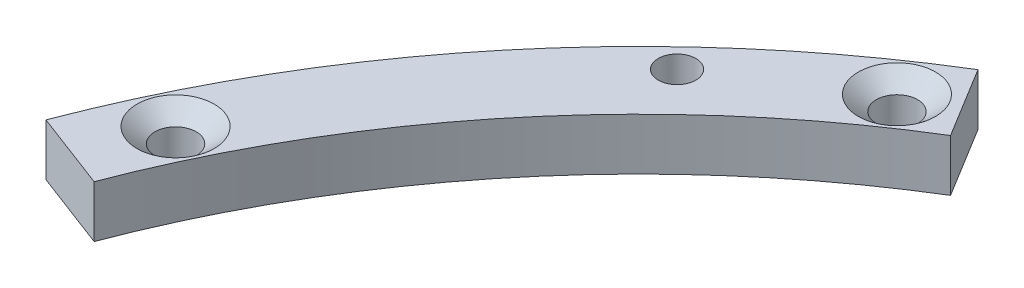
ISO-10303-21;
HEADER;
FILE_DESCRIPTION(('STEP AP214'),'2;1');
FILE_NAME('part.step','',(''),(''),'','','');
FILE_SCHEMA(('AUTOMOTIVE_DESIGN { 1 0 10303 214 1 1 1 1 }'));
ENDSEC;
DATA;
#1=APPLICATION_CONTEXT('core data for automotive mechanical design processes');
#2=APPLICATION_PROTOCOL_DEFINITION('international standard','automotive_design',2000,#1);
#3=PRODUCT_CONTEXT('',#1,'mechanical');
#4=PRODUCT('Part','Part','',(#3));
#5=PRODUCT_RELATED_PRODUCT_CATEGORY('part','',(#4));
#6=PRODUCT_DEFINITION_FORMATION('','',#4);
#7=PRODUCT_DEFINITION_CONTEXT('part definition',#1,'design');
#8=PRODUCT_DEFINITION('design','',#6,#7);
#9=PRODUCT_DEFINITION_SHAPE('','',#8);
#10=(LENGTH_UNIT() NAMED_UNIT(*) SI_UNIT(.MILLI.,.METRE.));
#11=(NAMED_UNIT(*) PLANE_ANGLE_UNIT() SI_UNIT($,.RADIAN.));
#12=(NAMED_UNIT(*) SI_UNIT($,.STERADIAN.) SOLID_ANGLE_UNIT());
#13=UNCERTAINTY_MEASURE_WITH_UNIT(LENGTH_MEASURE(1.E-05),#10,'distance_accuracy_value','');
#14=(GEOMETRIC_REPRESENTATION_CONTEXT(3) GLOBAL_UNCERTAINTY_ASSIGNED_CONTEXT((#13)) GLOBAL_UNIT_ASSIGNED_CONTEXT((#10,
#11,#12)) REPRESENTATION_CONTEXT('',''));
#15=CARTESIAN_POINT('',(0.,0.,0.));
#16=DIRECTION('',(0.,0.,1.));
#17=DIRECTION('',(1.,0.,0.));
#18=AXIS2_PLACEMENT_3D('',#15,#16,#17);
#19=CARTESIAN_POINT('',(0.,4.7625,0.));
#20=DIRECTION('',(0.,1.,0.));
#21=DIRECTION('',(0.,0.,1.));
#22=AXIS2_PLACEMENT_3D('',#19,#20,#21);
#23=PLANE('',#22);
#24=CARTESIAN_POINT('',(-50.8177060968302,4.7625,-74.4861708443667));
#25=DIRECTION('',(0.,1.,0.));
#26=DIRECTION('',(0.,0.,1.));
#27=AXIS2_PLACEMENT_3D('',#24,#25,#26);
#28=CIRCLE('',#27,3.5433);
#29=CARTESIAN_POINT('',(-50.8177060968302,4.7625,-70.9428708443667));
#30=VERTEX_POINT('',#29);
#31=EDGE_CURVE('E124',#30,#30,#28,.T.);
#32=ORIENTED_EDGE('',*,*,#31,.F.);
#33=EDGE_LOOP('',(#32));
#34=FACE_BOUND('',#33,.T.);
#35=CARTESIAN_POINT('',(-81.3932255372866,4.7625,-38.8042747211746));
#36=DIRECTION('',(0.,1.,0.));
#37=DIRECTION('',(0.,0.,1.));
#38=AXIS2_PLACEMENT_3D('',#35,#36,#37);
#39=CIRCLE('',#38,3.5433);
#40=CARTESIAN_POINT('',(-81.3932255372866,4.7625,-35.2609747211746));
#41=VERTEX_POINT('',#40);
#42=EDGE_CURVE('E113',#41,#41,#39,.T.);
#43=ORIENTED_EDGE('',*,*,#42,.F.);
#44=EDGE_LOOP('',(#43));
#45=FACE_BOUND('',#44,.T.);
#46=CARTESIAN_POINT('',(0.,4.7625,0.));
#47=DIRECTION('',(0.,-1.,0.));
#48=DIRECTION('',(0.,0.,1.));
#49=AXIS2_PLACEMENT_3D('',#46,#47,#48);
#50=CIRCLE('',#49,86.36);
#51=CARTESIAN_POINT('',(-80.7334856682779,4.7625,-30.6619290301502));
#52=VERTEX_POINT('',#51);
#53=CARTESIAN_POINT('',(-45.0738752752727,4.7625,-73.6640710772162));
#54=VERTEX_POINT('',#53);
#55=EDGE_CURVE('E83',#52,#54,#50,.T.);
#56=ORIENTED_EDGE('',*,*,#55,.T.);
#57=DIRECTION('',(-0.521930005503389,0.,-0.852988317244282));
#58=VECTOR('',#57,1.);
#59=CARTESIAN_POINT('',(-45.0738752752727,4.7625,-73.6640710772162));
#60=LINE('',#59,#58);
#61=CARTESIAN_POINT('',(-49.0509819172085,4.7625,-80.1638420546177));
#62=VERTEX_POINT('',#61);
#63=EDGE_CURVE('E78',#54,#62,#60,.T.);
#64=ORIENTED_EDGE('',*,*,#63,.T.);
#65=CARTESIAN_POINT('',(0.,4.7625,0.));
#66=DIRECTION('',(0.,1.,0.));
#67=DIRECTION('',(0.,0.,1.));
#68=AXIS2_PLACEMENT_3D('',#65,#66,#67);
#69=CIRCLE('',#68,93.98);
#70=CARTESIAN_POINT('',(-87.8570285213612,4.7625,-33.3673933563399));
#71=VERTEX_POINT('',#70);
#72=EDGE_CURVE('E81',#62,#71,#69,.T.);
#73=ORIENTED_EDGE('',*,*,#72,.T.);
#74=DIRECTION('',(0.934848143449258,0.,0.355047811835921));
#75=VECTOR('',#74,1.);
#76=CARTESIAN_POINT('',(-80.7334856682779,4.7625,-30.6619290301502));
#77=LINE('',#76,#75);
#78=EDGE_CURVE('E48',#71,#52,#77,.T.);
#79=ORIENTED_EDGE('',*,*,#78,.T.);
#80=EDGE_LOOP('',(#56,#64,#73,#79));
#81=FACE_BOUND('',#80,.T.);
#82=CARTESIAN_POINT('',(-62.8989083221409,4.7625,-66.3701810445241));
#83=DIRECTION('',(0.,1.,0.));
#84=DIRECTION('',(0.,0.,1.));
#85=AXIS2_PLACEMENT_3D('',#82,#83,#84);
#86=CIRCLE('',#85,1.7272);
#87=CARTESIAN_POINT('',(-62.8989083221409,4.7625,-68.0973810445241));
#88=VERTEX_POINT('',#87);
#89=EDGE_CURVE('E98',#88,#88,#86,.T.);
#90=ORIENTED_EDGE('',*,*,#89,.F.);
#91=EDGE_LOOP('',(#90));
#92=FACE_BOUND('',#91,.T.);
#93=ADVANCED_FACE('F31',(#34,#45,#81,#92),#23,.T.);
#94=CARTESIAN_POINT('',(0.,0.,0.));
#95=DIRECTION('',(0.,1.,0.));
#96=DIRECTION('',(0.,0.,1.));
#97=AXIS2_PLACEMENT_3D('',#94,#95,#96);
#98=PLANE('',#97);
#99=CARTESIAN_POINT('',(-50.8177060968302,0.,-74.4861708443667));
#100=DIRECTION('',(0.,1.,0.));
#101=DIRECTION('',(0.,0.,1.));
#102=AXIS2_PLACEMENT_3D('',#99,#100,#101);
#103=CIRCLE('',#102,1.89865);
#104=CARTESIAN_POINT('',(-50.8177060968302,0.,-72.5875208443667));
#105=VERTEX_POINT('',#104);
#106=EDGE_CURVE('E130',#105,#105,#103,.T.);
#107=ORIENTED_EDGE('',*,*,#106,.T.);
#108=EDGE_LOOP('',(#107));
#109=FACE_BOUND('',#108,.T.);
#110=CARTESIAN_POINT('',(-81.3932255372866,0.,-38.8042747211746));
#111=DIRECTION('',(0.,1.,0.));
#112=DIRECTION('',(0.,0.,1.));
#113=AXIS2_PLACEMENT_3D('',#110,#111,#112);
#114=CIRCLE('',#113,1.89865);
#115=CARTESIAN_POINT('',(-81.3932255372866,0.,-36.9056247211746));
#116=VERTEX_POINT('',#115);
#117=EDGE_CURVE('E121',#116,#116,#114,.T.);
#118=ORIENTED_EDGE('',*,*,#117,.T.);
#119=EDGE_LOOP('',(#118));
#120=FACE_BOUND('',#119,.T.);
#121=CARTESIAN_POINT('',(0.,0.,0.));
#122=DIRECTION('',(0.,-1.,0.));
#123=DIRECTION('',(0.,0.,1.));
#124=AXIS2_PLACEMENT_3D('',#121,#122,#123);
#125=CIRCLE('',#124,86.36);
#126=CARTESIAN_POINT('',(-80.7334856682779,0.,-30.6619290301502));
#127=VERTEX_POINT('',#126);
#128=CARTESIAN_POINT('',(-45.0738752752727,0.,-73.6640710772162));
#129=VERTEX_POINT('',#128);
#130=EDGE_CURVE('E95',#127,#129,#125,.T.);
#131=ORIENTED_EDGE('',*,*,#130,.F.);
#132=DIRECTION('',(0.934848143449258,0.,0.355047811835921));
#133=VECTOR('',#132,1.);
#134=CARTESIAN_POINT('',(-80.7334856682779,0.,-30.6619290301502));
#135=LINE('',#134,#133);
#136=CARTESIAN_POINT('',(-87.8570285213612,0.,-33.3673933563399));
#137=VERTEX_POINT('',#136);
#138=EDGE_CURVE('E71',#137,#127,#135,.T.);
#139=ORIENTED_EDGE('',*,*,#138,.F.);
#140=CARTESIAN_POINT('',(0.,0.,0.));
#141=DIRECTION('',(0.,1.,0.));
#142=DIRECTION('',(0.,0.,1.));
#143=AXIS2_PLACEMENT_3D('',#140,#141,#142);
#144=CIRCLE('',#143,93.98);
#145=CARTESIAN_POINT('',(-49.0509819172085,0.,-80.1638420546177));
#146=VERTEX_POINT('',#145);
#147=EDGE_CURVE('E65',#146,#137,#144,.T.);
#148=ORIENTED_EDGE('',*,*,#147,.F.);
#149=DIRECTION('',(-0.521930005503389,0.,-0.852988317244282));
#150=VECTOR('',#149,1.);
#151=CARTESIAN_POINT('',(-45.0738752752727,0.,-73.6640710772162));
#152=LINE('',#151,#150);
#153=EDGE_CURVE('E87',#129,#146,#152,.T.);
#154=ORIENTED_EDGE('',*,*,#153,.F.);
#155=EDGE_LOOP('',(#131,#139,#148,#154));
#156=FACE_BOUND('',#155,.T.);
#157=CARTESIAN_POINT('',(-62.8989083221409,0.,-66.3701810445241));
#158=DIRECTION('',(0.,1.,0.));
#159=DIRECTION('',(0.,0.,1.));
#160=AXIS2_PLACEMENT_3D('',#157,#158,#159);
#161=CIRCLE('',#160,1.7272);
#162=CARTESIAN_POINT('',(-62.8989083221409,0.,-68.0973810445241));
#163=VERTEX_POINT('',#162);
#164=EDGE_CURVE('E110',#163,#163,#161,.T.);
#165=ORIENTED_EDGE('',*,*,#164,.T.);
#166=EDGE_LOOP('',(#165));
#167=FACE_BOUND('',#166,.T.);
#168=ADVANCED_FACE('F106',(#109,#120,#156,#167),#98,.F.);
#169=CARTESIAN_POINT('',(0.,4.7625,0.));
#170=DIRECTION('',(0.,-1.,0.));
#171=DIRECTION('',(0.,0.,-1.));
#172=AXIS2_PLACEMENT_3D('',#169,#170,#171);
#173=CYLINDRICAL_SURFACE('',#172,86.36);
#174=ORIENTED_EDGE('',*,*,#130,.T.);
#175=DIRECTION('',(0.,-1.,0.));
#176=VECTOR('',#175,1.);
#177=CARTESIAN_POINT('',(-45.0738752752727,4.7625,-73.6640710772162));
#178=LINE('',#177,#176);
#179=EDGE_CURVE('E11',#54,#129,#178,.T.);
#180=ORIENTED_EDGE('',*,*,#179,.F.);
#181=ORIENTED_EDGE('',*,*,#55,.F.);
#182=DIRECTION('',(0.,-1.,0.));
#183=VECTOR('',#182,1.);
#184=CARTESIAN_POINT('',(-80.7334856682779,4.7625,-30.6619290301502));
#185=LINE('',#184,#183);
#186=EDGE_CURVE('E91',#52,#127,#185,.T.);
#187=ORIENTED_EDGE('',*,*,#186,.T.);
#188=EDGE_LOOP('',(#174,#180,#181,#187));
#189=FACE_BOUND('',#188,.T.);
#190=ADVANCED_FACE('F33',(#189),#173,.F.);
#191=CARTESIAN_POINT('',(-45.0738752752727,4.7625,-73.6640710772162));
#192=DIRECTION('',(-0.852988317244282,0.,0.521930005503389));
#193=DIRECTION('',(0.521930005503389,0.,0.852988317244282));
#194=AXIS2_PLACEMENT_3D('',#191,#192,#193);
#195=PLANE('',#194);
#196=ORIENTED_EDGE('',*,*,#153,.T.);
#197=DIRECTION('',(0.,-1.,0.));
#198=VECTOR('',#197,1.);
#199=CARTESIAN_POINT('',(-49.0509819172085,4.7625,-80.1638420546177));
#200=LINE('',#199,#198);
#201=EDGE_CURVE('E40',#62,#146,#200,.T.);
#202=ORIENTED_EDGE('',*,*,#201,.F.);
#203=ORIENTED_EDGE('',*,*,#63,.F.);
#204=ORIENTED_EDGE('',*,*,#179,.T.);
#205=EDGE_LOOP('',(#196,#202,#203,#204));
#206=FACE_BOUND('',#205,.T.);
#207=ADVANCED_FACE('F86',(#206),#195,.F.);
#208=CARTESIAN_POINT('',(0.,4.7625,0.));
#209=DIRECTION('',(0.,-1.,0.));
#210=DIRECTION('',(0.,0.,-1.));
#211=AXIS2_PLACEMENT_3D('',#208,#209,#210);
#212=CYLINDRICAL_SURFACE('',#211,93.98);
#213=ORIENTED_EDGE('',*,*,#147,.T.);
#214=DIRECTION('',(0.,-1.,0.));
#215=VECTOR('',#214,1.);
#216=CARTESIAN_POINT('',(-87.8570285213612,4.7625,-33.3673933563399));
#217=LINE('',#216,#215);
#218=EDGE_CURVE('E88',#71,#137,#217,.T.);
#219=ORIENTED_EDGE('',*,*,#218,.F.);
#220=ORIENTED_EDGE('',*,*,#72,.F.);
#221=ORIENTED_EDGE('',*,*,#201,.T.);
#222=EDGE_LOOP('',(#213,#219,#220,#221));
#223=FACE_BOUND('',#222,.T.);
#224=ADVANCED_FACE('F89',(#223),#212,.T.);
#225=CARTESIAN_POINT('',(-80.7334856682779,4.7625,-30.6619290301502));
#226=DIRECTION('',(0.355047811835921,0.,-0.934848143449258));
#227=DIRECTION('',(-0.934848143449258,0.,-0.355047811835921));
#228=AXIS2_PLACEMENT_3D('',#225,#226,#227);
#229=PLANE('',#228);
#230=ORIENTED_EDGE('',*,*,#138,.T.);
#231=ORIENTED_EDGE('',*,*,#186,.F.);
#232=ORIENTED_EDGE('',*,*,#78,.F.);
#233=ORIENTED_EDGE('',*,*,#218,.T.);
#234=EDGE_LOOP('',(#230,#231,#232,#233));
#235=FACE_BOUND('',#234,.T.);
#236=ADVANCED_FACE('F103',(#235),#229,.F.);
#237=CARTESIAN_POINT('',(-62.8989083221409,4.7625,-66.3701810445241));
#238=DIRECTION('',(0.,-1.,0.));
#239=DIRECTION('',(0.,0.,-1.));
#240=AXIS2_PLACEMENT_3D('',#237,#238,#239);
#241=CYLINDRICAL_SURFACE('',#240,1.7272);
#242=CARTESIAN_POINT('',(-62.8989083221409,4.7625,-68.0973810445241));
#243=CARTESIAN_POINT('',(-62.8989083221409,4.712890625,-68.0973810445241));
#244=CARTESIAN_POINT('',(-62.8989083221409,4.66328125,-68.0973810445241));
#245=CARTESIAN_POINT('',(-62.8989083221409,4.5640625,-68.0973810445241));
#246=CARTESIAN_POINT('',(-62.8989083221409,4.514453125,-68.0973810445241));
#247=CARTESIAN_POINT('',(-62.8989083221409,4.415234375,-68.0973810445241));
#248=CARTESIAN_POINT('',(-62.8989083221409,4.365625,-68.0973810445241));
#249=CARTESIAN_POINT('',(-62.8989083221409,4.26640625,-68.0973810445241));
#250=CARTESIAN_POINT('',(-62.8989083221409,4.216796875,-68.0973810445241));
#251=CARTESIAN_POINT('',(-62.8989083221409,4.117578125,-68.0973810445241));
#252=CARTESIAN_POINT('',(-62.8989083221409,4.06796875,-68.0973810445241));
#253=CARTESIAN_POINT('',(-62.8989083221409,3.96875,-68.0973810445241));
#254=CARTESIAN_POINT('',(-62.8989083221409,3.919140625,-68.0973810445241));
#255=CARTESIAN_POINT('',(-62.8989083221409,3.819921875,-68.0973810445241));
#256=CARTESIAN_POINT('',(-62.8989083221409,3.7703125,-68.0973810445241));
#257=CARTESIAN_POINT('',(-62.8989083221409,3.67109375,-68.0973810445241));
#258=CARTESIAN_POINT('',(-62.8989083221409,3.621484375,-68.0973810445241));
#259=CARTESIAN_POINT('',(-62.8989083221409,3.522265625,-68.0973810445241));
#260=CARTESIAN_POINT('',(-62.8989083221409,3.47265625,-68.0973810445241));
#261=CARTESIAN_POINT('',(-62.8989083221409,3.3734375,-68.0973810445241));
#262=CARTESIAN_POINT('',(-62.8989083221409,3.323828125,-68.0973810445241));
#263=CARTESIAN_POINT('',(-62.8989083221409,3.224609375,-68.0973810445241));
#264=CARTESIAN_POINT('',(-62.8989083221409,3.175,-68.0973810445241));
#265=CARTESIAN_POINT('',(-62.8989083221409,3.07578125,-68.0973810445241));
#266=CARTESIAN_POINT('',(-62.8989083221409,3.026171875,-68.0973810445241));
#267=CARTESIAN_POINT('',(-62.8989083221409,2.926953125,-68.0973810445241));
#268=CARTESIAN_POINT('',(-62.8989083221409,2.87734375,-68.0973810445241));
#269=CARTESIAN_POINT('',(-62.8989083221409,2.778125,-68.0973810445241));
#270=CARTESIAN_POINT('',(-62.8989083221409,2.728515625,-68.0973810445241));
#271=CARTESIAN_POINT('',(-62.8989083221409,2.629296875,-68.0973810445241));
#272=CARTESIAN_POINT('',(-62.8989083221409,2.5796875,-68.0973810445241));
#273=CARTESIAN_POINT('',(-62.8989083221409,2.48046875,-68.0973810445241));
#274=CARTESIAN_POINT('',(-62.8989083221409,2.430859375,-68.0973810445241));
#275=CARTESIAN_POINT('',(-62.8989083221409,2.331640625,-68.0973810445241));
#276=CARTESIAN_POINT('',(-62.8989083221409,2.28203125,-68.0973810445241));
#277=CARTESIAN_POINT('',(-62.8989083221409,2.1828125,-68.0973810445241));
#278=CARTESIAN_POINT('',(-62.8989083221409,2.133203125,-68.0973810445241));
#279=CARTESIAN_POINT('',(-62.8989083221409,2.033984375,-68.0973810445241));
#280=CARTESIAN_POINT('',(-62.8989083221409,1.984375,-68.0973810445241));
#281=CARTESIAN_POINT('',(-62.8989083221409,1.88515625,-68.0973810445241));
#282=CARTESIAN_POINT('',(-62.8989083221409,1.835546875,-68.0973810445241));
#283=CARTESIAN_POINT('',(-62.8989083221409,1.736328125,-68.0973810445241));
#284=CARTESIAN_POINT('',(-62.8989083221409,1.68671875,-68.0973810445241));
#285=CARTESIAN_POINT('',(-62.8989083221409,1.5875,-68.0973810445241));
#286=CARTESIAN_POINT('',(-62.8989083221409,1.537890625,-68.0973810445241));
#287=CARTESIAN_POINT('',(-62.8989083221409,1.438671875,-68.0973810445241));
#288=CARTESIAN_POINT('',(-62.8989083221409,1.3890625,-68.0973810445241));
#289=CARTESIAN_POINT('',(-62.8989083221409,1.28984375,-68.0973810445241));
#290=CARTESIAN_POINT('',(-62.8989083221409,1.240234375,-68.0973810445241));
#291=CARTESIAN_POINT('',(-62.8989083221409,1.141015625,-68.0973810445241));
#292=CARTESIAN_POINT('',(-62.8989083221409,1.09140625,-68.0973810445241));
#293=CARTESIAN_POINT('',(-62.8989083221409,0.992187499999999,-68.0973810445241));
#294=CARTESIAN_POINT('',(-62.8989083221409,0.942578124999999,-68.0973810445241));
#295=CARTESIAN_POINT('',(-62.8989083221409,0.843359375,-68.0973810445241));
#296=CARTESIAN_POINT('',(-62.8989083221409,0.79375,-68.0973810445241));
#297=CARTESIAN_POINT('',(-62.8989083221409,0.69453125,-68.0973810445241));
#298=CARTESIAN_POINT('',(-62.8989083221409,0.644921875,-68.0973810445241));
#299=CARTESIAN_POINT('',(-62.8989083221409,0.545703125,-68.0973810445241));
#300=CARTESIAN_POINT('',(-62.8989083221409,0.49609375,-68.0973810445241));
#301=CARTESIAN_POINT('',(-62.8989083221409,0.396875,-68.0973810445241));
#302=CARTESIAN_POINT('',(-62.8989083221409,0.347265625,-68.0973810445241));
#303=CARTESIAN_POINT('',(-62.8989083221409,0.248046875,-68.0973810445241));
#304=CARTESIAN_POINT('',(-62.8989083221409,0.1984375,-68.0973810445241));
#305=CARTESIAN_POINT('',(-62.8989083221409,0.09921875,-68.0973810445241));
#306=CARTESIAN_POINT('',(-62.8989083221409,0.049609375,-68.0973810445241));
#307=CARTESIAN_POINT('',(-62.8989083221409,0.,-68.0973810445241));
#308=B_SPLINE_CURVE_WITH_KNOTS('',3,(#242,#243,#244,#245,#246,#247,#248,#249,#250,#251,#252,
#253,#254,#255,#256,#257,#258,#259,#260,#261,#262,#263,#264,#265,#266,#267,#268,#269,#270,#271,
#272,#273,#274,#275,#276,#277,#278,#279,#280,#281,#282,#283,#284,#285,#286,#287,#288,#289,#290,
#291,#292,#293,#294,#295,#296,#297,#298,#299,#300,#301,#302,#303,#304,#305,#306,#307),
.UNSPECIFIED.,.F.,.F.,(4,2,2,2,2,2,2,2,2,2,2,2,2,2,2,2,2,2,2,2,2,2,2,2,2,2,2,2,2,2,2,2,4),(0.,
0.148828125,0.29765625,0.446484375,0.5953125,0.744140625,0.892968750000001,1.041796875,1.190625,
1.339453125,1.48828125,1.637109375,1.7859375,1.934765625,2.08359375,2.232421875,2.38125,
2.530078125,2.67890625,2.827734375,2.9765625,3.125390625,3.27421875,3.423046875,3.571875,
3.720703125,3.86953125,4.018359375,4.1671875,4.316015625,4.46484375,4.613671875,4.7625),.UNSPECIFIED.);
#309=EDGE_CURVE('BSEAM156',#88,#163,#308,.T.);
#310=ORIENTED_EDGE('',*,*,#89,.T.);
#311=ORIENTED_EDGE('',*,*,#164,.F.);
#312=ORIENTED_EDGE('',*,*,#309,.T.);
#313=ORIENTED_EDGE('',*,*,#309,.F.);
#314=EDGE_LOOP('',(#310,#312,#311,#313));
#315=FACE_BOUND('',#314,.T.);
#316=ADVANCED_FACE('F156',(#315),#241,.F.);
#317=CARTESIAN_POINT('',(-81.3932255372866,4.7625,-38.8042747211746));
#318=DIRECTION('',(0.,1.,0.));
#319=DIRECTION('',(0.,0.,1.));
#320=AXIS2_PLACEMENT_3D('',#317,#318,#319);
#321=CONICAL_SURFACE('',#320,3.5433,0.872664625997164);
#322=CARTESIAN_POINT('',(-81.3932255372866,3.38247479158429,-38.8042747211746));
#323=DIRECTION('',(0.,1.,0.));
#324=DIRECTION('',(0.,0.,1.));
#325=AXIS2_PLACEMENT_3D('',#322,#323,#324);
#326=CIRCLE('',#325,1.89865);
#327=CARTESIAN_POINT('',(-81.3932255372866,3.38247479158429,-36.9056247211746));
#328=VERTEX_POINT('',#327);
#329=EDGE_CURVE('E118',#328,#328,#326,.T.);
#330=ORIENTED_EDGE('',*,*,#329,.F.);
#331=EDGE_LOOP('',(#330));
#332=FACE_BOUND('',#331,.T.);
#333=ORIENTED_EDGE('',*,*,#42,.T.);
#334=EDGE_LOOP('',(#333));
#335=FACE_BOUND('',#334,.T.);
#336=ADVANCED_FACE('F154',(#332,#335),#321,.F.);
#337=CARTESIAN_POINT('',(-81.3932255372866,4.7625,-38.8042747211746));
#338=DIRECTION('',(0.,1.,0.));
#339=DIRECTION('',(0.,0.,1.));
#340=AXIS2_PLACEMENT_3D('',#337,#338,#339);
#341=CYLINDRICAL_SURFACE('',#340,1.89865);
#342=ORIENTED_EDGE('',*,*,#117,.F.);
#343=EDGE_LOOP('',(#342));
#344=FACE_BOUND('',#343,.T.);
#345=ORIENTED_EDGE('',*,*,#329,.T.);
#346=EDGE_LOOP('',(#345));
#347=FACE_BOUND('',#346,.T.);
#348=ADVANCED_FACE('F145',(#344,#347),#341,.F.);
#349=CARTESIAN_POINT('',(-50.8177060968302,4.7625,-74.4861708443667));
#350=DIRECTION('',(0.,1.,0.));
#351=DIRECTION('',(0.,0.,1.));
#352=AXIS2_PLACEMENT_3D('',#349,#350,#351);
#353=CONICAL_SURFACE('',#352,3.5433,0.872664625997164);
#354=CARTESIAN_POINT('',(-50.8177060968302,3.38247479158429,-74.4861708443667));
#355=DIRECTION('',(0.,1.,0.));
#356=DIRECTION('',(0.,0.,1.));
#357=AXIS2_PLACEMENT_3D('',#354,#355,#356);
#358=CIRCLE('',#357,1.89865);
#359=CARTESIAN_POINT('',(-50.8177060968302,3.38247479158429,-72.5875208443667));
#360=VERTEX_POINT('',#359);
#361=EDGE_CURVE('E127',#360,#360,#358,.T.);
#362=ORIENTED_EDGE('',*,*,#361,.F.);
#363=EDGE_LOOP('',(#362));
#364=FACE_BOUND('',#363,.T.);
#365=ORIENTED_EDGE('',*,*,#31,.T.);
#366=EDGE_LOOP('',(#365));
#367=FACE_BOUND('',#366,.T.);
#368=ADVANCED_FACE('F139',(#364,#367),#353,.F.);
#369=CARTESIAN_POINT('',(-50.8177060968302,4.7625,-74.4861708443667));
#370=DIRECTION('',(0.,1.,0.));
#371=DIRECTION('',(0.,0.,1.));
#372=AXIS2_PLACEMENT_3D('',#369,#370,#371);
#373=CYLINDRICAL_SURFACE('',#372,1.89865);
#374=ORIENTED_EDGE('',*,*,#106,.F.);
#375=EDGE_LOOP('',(#374));
#376=FACE_BOUND('',#375,.T.);
#377=ORIENTED_EDGE('',*,*,#361,.T.);
#378=EDGE_LOOP('',(#377));
#379=FACE_BOUND('',#378,.T.);
#380=ADVANCED_FACE('F136',(#376,#379),#373,.F.);
#381=CLOSED_SHELL('',(#93,#168,#190,#207,#224,#236,#316,#336,#348,#368,#380));
#382=MANIFOLD_SOLID_BREP('B2',#381);
#383=ADVANCED_BREP_SHAPE_REPRESENTATION('',(#18,#382),#14);
#384=SHAPE_DEFINITION_REPRESENTATION(#9,#383);
ENDSEC;
END-ISO-10303-21;
